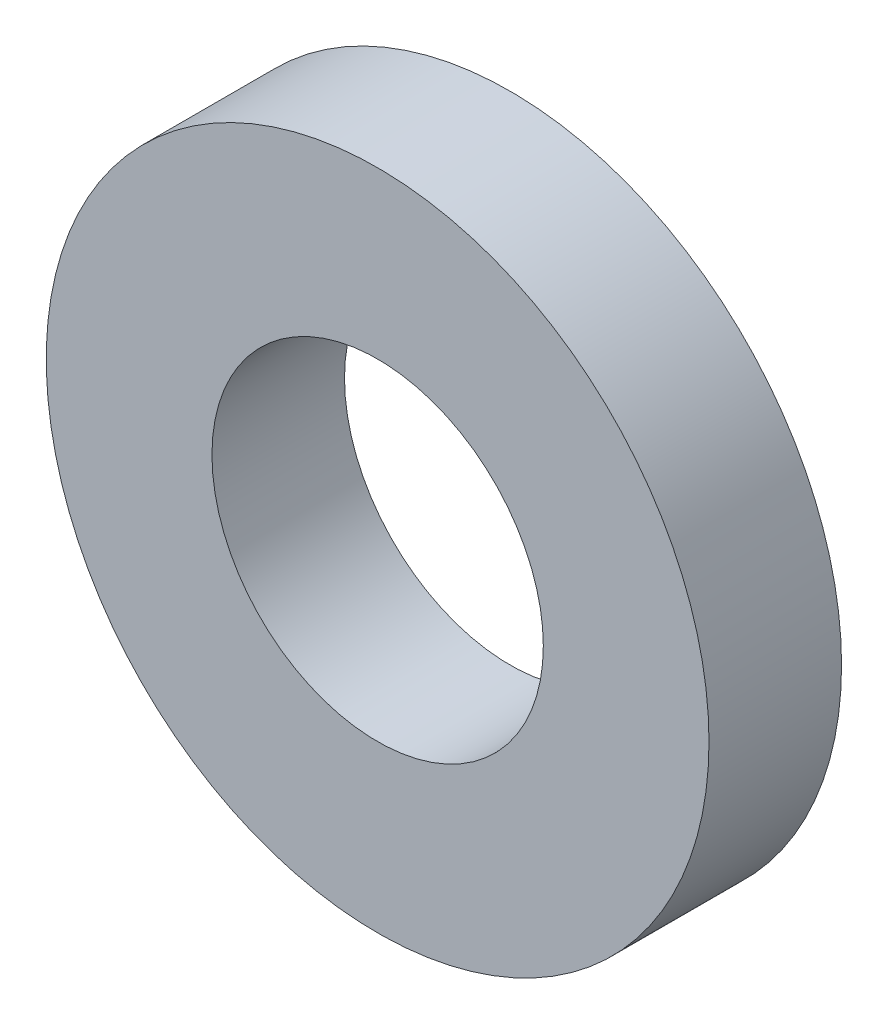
ISO-10303-21;
HEADER;
FILE_DESCRIPTION(('STEP AP214'),'2;1');
FILE_NAME('part.step','',(''),(''),'','','');
FILE_SCHEMA(('AUTOMOTIVE_DESIGN { 1 0 10303 214 1 1 1 1 }'));
ENDSEC;
DATA;
#1=APPLICATION_CONTEXT('core data for automotive mechanical design processes');
#2=APPLICATION_PROTOCOL_DEFINITION('international standard','automotive_design',2000,#1);
#3=PRODUCT_CONTEXT('',#1,'mechanical');
#4=PRODUCT('Part','Part','',(#3));
#5=PRODUCT_RELATED_PRODUCT_CATEGORY('part','',(#4));
#6=PRODUCT_DEFINITION_FORMATION('','',#4);
#7=PRODUCT_DEFINITION_CONTEXT('part definition',#1,'design');
#8=PRODUCT_DEFINITION('design','',#6,#7);
#9=PRODUCT_DEFINITION_SHAPE('','',#8);
#10=(LENGTH_UNIT() NAMED_UNIT(*) SI_UNIT(.MILLI.,.METRE.));
#11=(NAMED_UNIT(*) PLANE_ANGLE_UNIT() SI_UNIT($,.RADIAN.));
#12=(NAMED_UNIT(*) SI_UNIT($,.STERADIAN.) SOLID_ANGLE_UNIT());
#13=UNCERTAINTY_MEASURE_WITH_UNIT(LENGTH_MEASURE(1.E-05),#10,'distance_accuracy_value','');
#14=(GEOMETRIC_REPRESENTATION_CONTEXT(3) GLOBAL_UNCERTAINTY_ASSIGNED_CONTEXT((#13)) GLOBAL_UNIT_ASSIGNED_CONTEXT((#10,
#11,#12)) REPRESENTATION_CONTEXT('',''));
#15=CARTESIAN_POINT('',(0.,0.,0.));
#16=DIRECTION('',(0.,0.,1.));
#17=DIRECTION('',(1.,0.,0.));
#18=AXIS2_PLACEMENT_3D('',#15,#16,#17);
#19=CARTESIAN_POINT('',(0.,0.,10.));
#20=DIRECTION('',(0.,0.,1.));
#21=DIRECTION('',(1.,0.,0.));
#22=AXIS2_PLACEMENT_3D('',#19,#20,#21);
#23=PLANE('',#22);
#24=CARTESIAN_POINT('',(0.,0.,10.));
#25=DIRECTION('',(0.,0.,1.));
#26=DIRECTION('',(1.,0.,0.));
#27=AXIS2_PLACEMENT_3D('',#24,#25,#26);
#28=CIRCLE('',#27,25.);
#29=CARTESIAN_POINT('',(25.,0.,10.));
#30=VERTEX_POINT('',#29);
#31=EDGE_CURVE('E10',#30,#30,#28,.T.);
#32=ORIENTED_EDGE('',*,*,#31,.T.);
#33=EDGE_LOOP('',(#32));
#34=FACE_BOUND('',#33,.T.);
#35=CARTESIAN_POINT('',(0.,0.,10.));
#36=DIRECTION('',(0.,0.,1.));
#37=DIRECTION('',(1.,0.,0.));
#38=AXIS2_PLACEMENT_3D('',#35,#36,#37);
#39=CIRCLE('',#38,12.5);
#40=CARTESIAN_POINT('',(12.5,0.,10.));
#41=VERTEX_POINT('',#40);
#42=EDGE_CURVE('E39',#41,#41,#39,.T.);
#43=ORIENTED_EDGE('',*,*,#42,.F.);
#44=EDGE_LOOP('',(#43));
#45=FACE_BOUND('',#44,.T.);
#46=ADVANCED_FACE('F28',(#34,#45),#23,.T.);
#47=CARTESIAN_POINT('',(0.,0.,0.));
#48=DIRECTION('',(0.,0.,1.));
#49=DIRECTION('',(1.,0.,0.));
#50=AXIS2_PLACEMENT_3D('',#47,#48,#49);
#51=PLANE('',#50);
#52=CARTESIAN_POINT('',(0.,0.,0.));
#53=DIRECTION('',(0.,0.,1.));
#54=DIRECTION('',(1.,0.,0.));
#55=AXIS2_PLACEMENT_3D('',#52,#53,#54);
#56=CIRCLE('',#55,25.);
#57=CARTESIAN_POINT('',(25.,0.,0.));
#58=VERTEX_POINT('',#57);
#59=EDGE_CURVE('E35',#58,#58,#56,.T.);
#60=ORIENTED_EDGE('',*,*,#59,.F.);
#61=EDGE_LOOP('',(#60));
#62=FACE_BOUND('',#61,.T.);
#63=CARTESIAN_POINT('',(0.,0.,0.));
#64=DIRECTION('',(0.,0.,1.));
#65=DIRECTION('',(1.,0.,0.));
#66=AXIS2_PLACEMENT_3D('',#63,#64,#65);
#67=CIRCLE('',#66,12.5);
#68=CARTESIAN_POINT('',(12.5,0.,0.));
#69=VERTEX_POINT('',#68);
#70=EDGE_CURVE('E43',#69,#69,#67,.T.);
#71=ORIENTED_EDGE('',*,*,#70,.T.);
#72=EDGE_LOOP('',(#71));
#73=FACE_BOUND('',#72,.T.);
#74=ADVANCED_FACE('F49',(#62,#73),#51,.F.);
#75=CARTESIAN_POINT('',(0.,0.,10.));
#76=DIRECTION('',(0.,0.,-1.));
#77=DIRECTION('',(-1.,0.,0.));
#78=AXIS2_PLACEMENT_3D('',#75,#76,#77);
#79=CYLINDRICAL_SURFACE('',#78,25.);
#80=ORIENTED_EDGE('',*,*,#31,.F.);
#81=EDGE_LOOP('',(#80));
#82=FACE_BOUND('',#81,.T.);
#83=ORIENTED_EDGE('',*,*,#59,.T.);
#84=EDGE_LOOP('',(#83));
#85=FACE_BOUND('',#84,.T.);
#86=ADVANCED_FACE('F30',(#82,#85),#79,.T.);
#87=CARTESIAN_POINT('',(0.,0.,10.));
#88=DIRECTION('',(0.,0.,-1.));
#89=DIRECTION('',(-1.,0.,0.));
#90=AXIS2_PLACEMENT_3D('',#87,#88,#89);
#91=CYLINDRICAL_SURFACE('',#90,12.5);
#92=ORIENTED_EDGE('',*,*,#42,.T.);
#93=EDGE_LOOP('',(#92));
#94=FACE_BOUND('',#93,.T.);
#95=ORIENTED_EDGE('',*,*,#70,.F.);
#96=EDGE_LOOP('',(#95));
#97=FACE_BOUND('',#96,.T.);
#98=ADVANCED_FACE('F51',(#94,#97),#91,.F.);
#99=CLOSED_SHELL('',(#46,#74,#86,#98));
#100=MANIFOLD_SOLID_BREP('B2',#99);
#101=ADVANCED_BREP_SHAPE_REPRESENTATION('',(#18,#100),#14);
#102=SHAPE_DEFINITION_REPRESENTATION(#9,#101);
ENDSEC;
END-ISO-10303-21;
